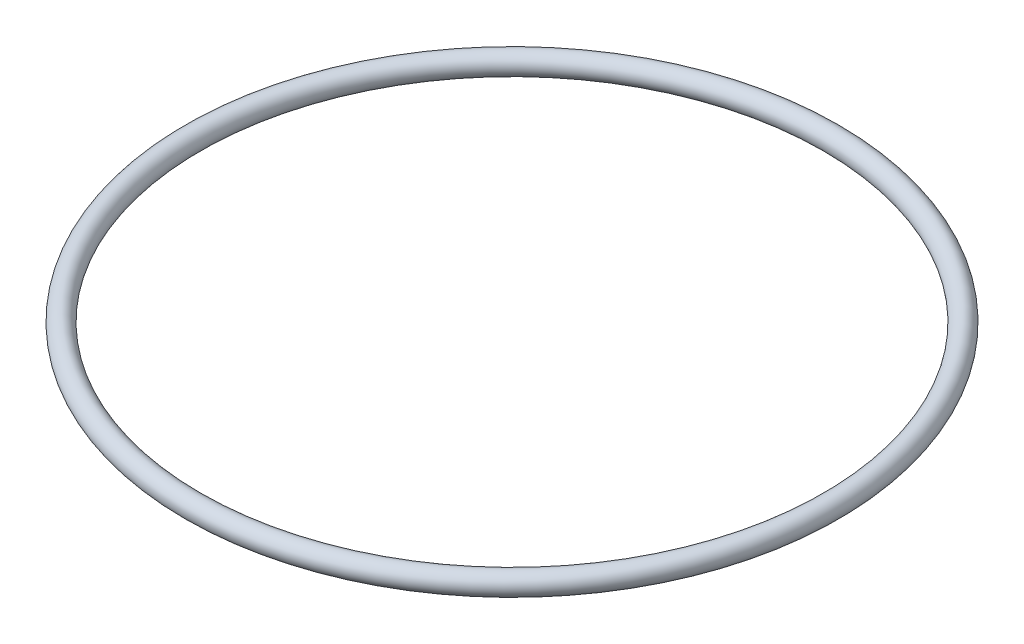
ISO-10303-21;
HEADER;
FILE_DESCRIPTION(('STEP AP214'),'2;1');
FILE_NAME('part.step','',(''),(''),'','','');
FILE_SCHEMA(('AUTOMOTIVE_DESIGN { 1 0 10303 214 1 1 1 1 }'));
ENDSEC;
DATA;
#1=APPLICATION_CONTEXT('core data for automotive mechanical design processes');
#2=APPLICATION_PROTOCOL_DEFINITION('international standard','automotive_design',2000,#1);
#3=PRODUCT_CONTEXT('',#1,'mechanical');
#4=PRODUCT('Part','Part','',(#3));
#5=PRODUCT_RELATED_PRODUCT_CATEGORY('part','',(#4));
#6=PRODUCT_DEFINITION_FORMATION('','',#4);
#7=PRODUCT_DEFINITION_CONTEXT('part definition',#1,'design');
#8=PRODUCT_DEFINITION('design','',#6,#7);
#9=PRODUCT_DEFINITION_SHAPE('','',#8);
#10=(LENGTH_UNIT() NAMED_UNIT(*) SI_UNIT(.MILLI.,.METRE.));
#11=(NAMED_UNIT(*) PLANE_ANGLE_UNIT() SI_UNIT($,.RADIAN.));
#12=(NAMED_UNIT(*) SI_UNIT($,.STERADIAN.) SOLID_ANGLE_UNIT());
#13=UNCERTAINTY_MEASURE_WITH_UNIT(LENGTH_MEASURE(1.E-05),#10,'distance_accuracy_value','');
#14=(GEOMETRIC_REPRESENTATION_CONTEXT(3) GLOBAL_UNCERTAINTY_ASSIGNED_CONTEXT((#13)) GLOBAL_UNIT_ASSIGNED_CONTEXT((#10,
#11,#12)) REPRESENTATION_CONTEXT('',''));
#15=CARTESIAN_POINT('',(0.,0.,0.));
#16=DIRECTION('',(0.,0.,1.));
#17=DIRECTION('',(1.,0.,0.));
#18=AXIS2_PLACEMENT_3D('',#15,#16,#17);
#19=CARTESIAN_POINT('',(0.,0.,0.));
#20=DIRECTION('',(0.,1.,0.));
#21=DIRECTION('',(0.,0.,1.));
#22=AXIS2_PLACEMENT_3D('',#19,#20,#21);
#23=TOROIDAL_SURFACE('',#22,39.243,1.3081);
#24=CARTESIAN_POINT('',(0.,0.,40.5511));
#25=VERTEX_POINT('',#24);
#26=VERTEX_LOOP('',#25);
#27=FACE_BOUND('',#26,.T.);
#28=ADVANCED_FACE('F35',(#27),#23,.T.);
#29=CLOSED_SHELL('',(#28));
#30=MANIFOLD_SOLID_BREP('B2',#29);
#31=ADVANCED_BREP_SHAPE_REPRESENTATION('',(#18,#30),#14);
#32=SHAPE_DEFINITION_REPRESENTATION(#9,#31);
ENDSEC;
END-ISO-10303-21;
